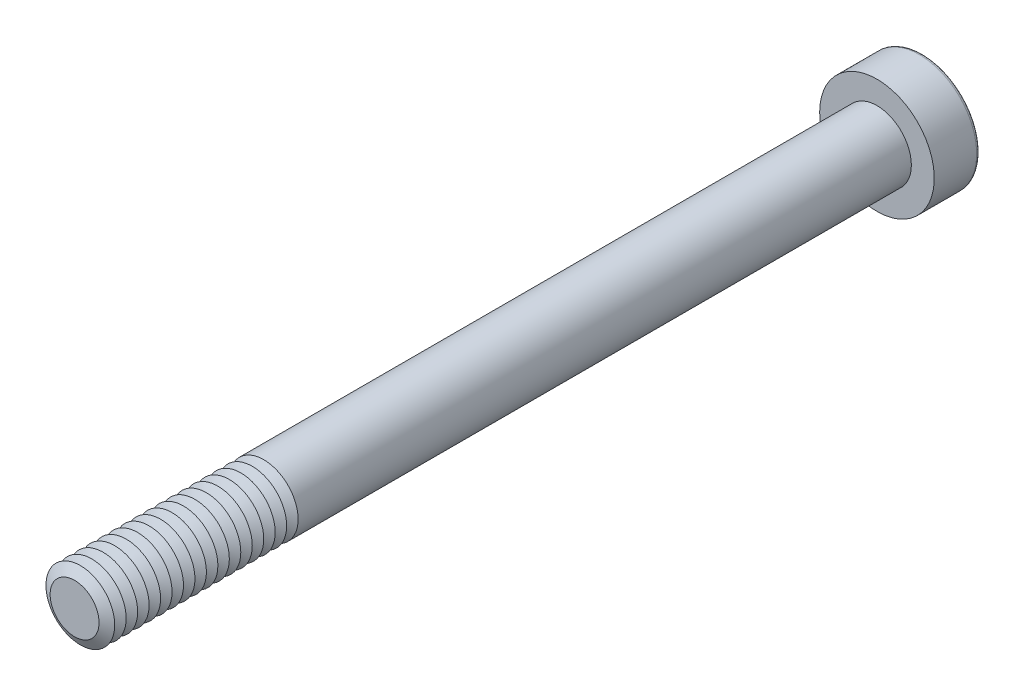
ISO-10303-21;
HEADER;
FILE_DESCRIPTION(('STEP AP214'),'2;1');
FILE_NAME('part.step','',(''),(''),'','','');
FILE_SCHEMA(('AUTOMOTIVE_DESIGN { 1 0 10303 214 1 1 1 1 }'));
ENDSEC;
DATA;
#1=APPLICATION_CONTEXT('core data for automotive mechanical design processes');
#2=APPLICATION_PROTOCOL_DEFINITION('international standard','automotive_design',2000,#1);
#3=PRODUCT_CONTEXT('',#1,'mechanical');
#4=PRODUCT('Part','Part','',(#3));
#5=PRODUCT_RELATED_PRODUCT_CATEGORY('part','',(#4));
#6=PRODUCT_DEFINITION_FORMATION('','',#4);
#7=PRODUCT_DEFINITION_CONTEXT('part definition',#1,'design');
#8=PRODUCT_DEFINITION('design','',#6,#7);
#9=PRODUCT_DEFINITION_SHAPE('','',#8);
#10=(LENGTH_UNIT() NAMED_UNIT(*) SI_UNIT(.MILLI.,.METRE.));
#11=(NAMED_UNIT(*) PLANE_ANGLE_UNIT() SI_UNIT($,.RADIAN.));
#12=(NAMED_UNIT(*) SI_UNIT($,.STERADIAN.) SOLID_ANGLE_UNIT());
#13=UNCERTAINTY_MEASURE_WITH_UNIT(LENGTH_MEASURE(1.E-05),#10,'distance_accuracy_value','');
#14=(GEOMETRIC_REPRESENTATION_CONTEXT(3) GLOBAL_UNCERTAINTY_ASSIGNED_CONTEXT((#13)) GLOBAL_UNIT_ASSIGNED_CONTEXT((#10,
#11,#12)) REPRESENTATION_CONTEXT('',''));
#15=CARTESIAN_POINT('',(0.,0.,0.));
#16=DIRECTION('',(0.,0.,1.));
#17=DIRECTION('',(1.,0.,0.));
#18=AXIS2_PLACEMENT_3D('',#15,#16,#17);
#19=CARTESIAN_POINT('',(0.,0.,66.5));
#20=DIRECTION('',(0.,0.,1.));
#21=DIRECTION('',(1.,0.,0.));
#22=AXIS2_PLACEMENT_3D('',#19,#20,#21);
#23=CONICAL_SURFACE('',#22,3.,1.0471975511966);
#24=CARTESIAN_POINT('',(0.,0.,66.));
#25=DIRECTION('',(0.,0.,1.));
#26=DIRECTION('',(1.,0.,0.));
#27=AXIS2_PLACEMENT_3D('',#24,#25,#26);
#28=CIRCLE('',#27,2.13397459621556);
#29=CARTESIAN_POINT('',(2.13397459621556,0.,66.));
#30=VERTEX_POINT('',#29);
#31=EDGE_CURVE('E313',#30,#30,#28,.T.);
#32=ORIENTED_EDGE('',*,*,#31,.T.);
#33=EDGE_LOOP('',(#32));
#34=FACE_BOUND('',#33,.T.);
#35=CARTESIAN_POINT('',(0.,0.,66.5));
#36=DIRECTION('',(0.,0.,1.));
#37=DIRECTION('',(1.,0.,0.));
#38=AXIS2_PLACEMENT_3D('',#35,#36,#37);
#39=CIRCLE('',#38,3.);
#40=CARTESIAN_POINT('',(3.,0.,66.5));
#41=VERTEX_POINT('',#40);
#42=EDGE_CURVE('E316',#41,#41,#39,.T.);
#43=ORIENTED_EDGE('',*,*,#42,.F.);
#44=EDGE_LOOP('',(#43));
#45=FACE_BOUND('',#44,.T.);
#46=ADVANCED_FACE('F39',(#34,#45),#23,.T.);
#47=CARTESIAN_POINT('',(0.,0.,66.));
#48=DIRECTION('',(0.,0.,-1.));
#49=DIRECTION('',(-1.,0.,0.));
#50=AXIS2_PLACEMENT_3D('',#47,#48,#49);
#51=CONICAL_SURFACE('',#50,2.13397459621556,1.0471975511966);
#52=CARTESIAN_POINT('',(0.,0.,65.5));
#53=DIRECTION('',(0.,0.,1.));
#54=DIRECTION('',(1.,0.,0.));
#55=AXIS2_PLACEMENT_3D('',#52,#53,#54);
#56=CIRCLE('',#55,3.);
#57=CARTESIAN_POINT('',(3.,0.,65.5));
#58=VERTEX_POINT('',#57);
#59=EDGE_CURVE('E324',#58,#58,#56,.T.);
#60=ORIENTED_EDGE('',*,*,#59,.T.);
#61=EDGE_LOOP('',(#60));
#62=FACE_BOUND('',#61,.T.);
#63=ORIENTED_EDGE('',*,*,#31,.F.);
#64=EDGE_LOOP('',(#63));
#65=FACE_BOUND('',#64,.T.);
#66=ADVANCED_FACE('F244',(#62,#65),#51,.T.);
#67=CARTESIAN_POINT('',(0.,0.,70.));
#68=DIRECTION('',(0.,0.,1.));
#69=DIRECTION('',(1.,0.,0.));
#70=AXIS2_PLACEMENT_3D('',#67,#68,#69);
#71=PLANE('',#70);
#72=CARTESIAN_POINT('',(0.,0.,70.));
#73=DIRECTION('',(0.,0.,1.));
#74=DIRECTION('',(1.,0.,0.));
#75=AXIS2_PLACEMENT_3D('',#72,#73,#74);
#76=CIRCLE('',#75,2.13397459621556);
#77=CARTESIAN_POINT('',(2.13397459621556,0.,70.));
#78=VERTEX_POINT('',#77);
#79=EDGE_CURVE('E173',#78,#78,#76,.T.);
#80=ORIENTED_EDGE('',*,*,#79,.T.);
#81=EDGE_LOOP('',(#80));
#82=FACE_BOUND('',#81,.T.);
#83=ADVANCED_FACE('F250',(#82),#71,.T.);
#84=CARTESIAN_POINT('',(0.,0.,70.));
#85=DIRECTION('',(0.,0.,-1.));
#86=DIRECTION('',(-1.,0.,0.));
#87=AXIS2_PLACEMENT_3D('',#84,#85,#86);
#88=CONICAL_SURFACE('',#87,2.13397459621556,1.0471975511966);
#89=CARTESIAN_POINT('',(0.,0.,69.5));
#90=DIRECTION('',(0.,0.,1.));
#91=DIRECTION('',(1.,0.,0.));
#92=AXIS2_PLACEMENT_3D('',#89,#90,#91);
#93=CIRCLE('',#92,3.);
#94=CARTESIAN_POINT('',(3.,0.,69.5));
#95=VERTEX_POINT('',#94);
#96=EDGE_CURVE('E290',#95,#95,#93,.T.);
#97=ORIENTED_EDGE('',*,*,#96,.T.);
#98=EDGE_LOOP('',(#97));
#99=FACE_BOUND('',#98,.T.);
#100=ORIENTED_EDGE('',*,*,#79,.F.);
#101=EDGE_LOOP('',(#100));
#102=FACE_BOUND('',#101,.T.);
#103=ADVANCED_FACE('F198',(#99,#102),#88,.T.);
#104=CARTESIAN_POINT('',(0.,0.,69.5));
#105=DIRECTION('',(0.,0.,1.));
#106=DIRECTION('',(1.,0.,0.));
#107=AXIS2_PLACEMENT_3D('',#104,#105,#106);
#108=CONICAL_SURFACE('',#107,3.,1.0471975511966);
#109=CARTESIAN_POINT('',(0.,0.,69.));
#110=DIRECTION('',(0.,0.,1.));
#111=DIRECTION('',(1.,0.,0.));
#112=AXIS2_PLACEMENT_3D('',#109,#110,#111);
#113=CIRCLE('',#112,2.13397459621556);
#114=CARTESIAN_POINT('',(2.13397459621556,0.,69.));
#115=VERTEX_POINT('',#114);
#116=EDGE_CURVE('E287',#115,#115,#113,.T.);
#117=ORIENTED_EDGE('',*,*,#116,.T.);
#118=EDGE_LOOP('',(#117));
#119=FACE_BOUND('',#118,.T.);
#120=ORIENTED_EDGE('',*,*,#96,.F.);
#121=EDGE_LOOP('',(#120));
#122=FACE_BOUND('',#121,.T.);
#123=ADVANCED_FACE('F276',(#119,#122),#108,.T.);
#124=CARTESIAN_POINT('',(0.,0.,69.));
#125=DIRECTION('',(0.,0.,-1.));
#126=DIRECTION('',(-1.,0.,0.));
#127=AXIS2_PLACEMENT_3D('',#124,#125,#126);
#128=CONICAL_SURFACE('',#127,2.13397459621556,1.0471975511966);
#129=CARTESIAN_POINT('',(0.,0.,68.5));
#130=DIRECTION('',(0.,0.,1.));
#131=DIRECTION('',(1.,0.,0.));
#132=AXIS2_PLACEMENT_3D('',#129,#130,#131);
#133=CIRCLE('',#132,3.);
#134=CARTESIAN_POINT('',(3.,0.,68.5));
#135=VERTEX_POINT('',#134);
#136=EDGE_CURVE('E299',#135,#135,#133,.T.);
#137=ORIENTED_EDGE('',*,*,#136,.T.);
#138=EDGE_LOOP('',(#137));
#139=FACE_BOUND('',#138,.T.);
#140=ORIENTED_EDGE('',*,*,#116,.F.);
#141=EDGE_LOOP('',(#140));
#142=FACE_BOUND('',#141,.T.);
#143=ADVANCED_FACE('F273',(#139,#142),#128,.T.);
#144=CARTESIAN_POINT('',(0.,0.,68.5));
#145=DIRECTION('',(0.,0.,1.));
#146=DIRECTION('',(1.,0.,0.));
#147=AXIS2_PLACEMENT_3D('',#144,#145,#146);
#148=CONICAL_SURFACE('',#147,3.,1.0471975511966);
#149=CARTESIAN_POINT('',(0.,0.,68.));
#150=DIRECTION('',(0.,0.,1.));
#151=DIRECTION('',(1.,0.,0.));
#152=AXIS2_PLACEMENT_3D('',#149,#150,#151);
#153=CIRCLE('',#152,2.13397459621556);
#154=CARTESIAN_POINT('',(2.13397459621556,0.,68.));
#155=VERTEX_POINT('',#154);
#156=EDGE_CURVE('E292',#155,#155,#153,.T.);
#157=ORIENTED_EDGE('',*,*,#156,.T.);
#158=EDGE_LOOP('',(#157));
#159=FACE_BOUND('',#158,.T.);
#160=ORIENTED_EDGE('',*,*,#136,.F.);
#161=EDGE_LOOP('',(#160));
#162=FACE_BOUND('',#161,.T.);
#163=ADVANCED_FACE('F269',(#159,#162),#148,.T.);
#164=CARTESIAN_POINT('',(0.,0.,68.));
#165=DIRECTION('',(0.,0.,-1.));
#166=DIRECTION('',(-1.,0.,0.));
#167=AXIS2_PLACEMENT_3D('',#164,#165,#166);
#168=CONICAL_SURFACE('',#167,2.13397459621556,1.0471975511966);
#169=CARTESIAN_POINT('',(0.,0.,67.5));
#170=DIRECTION('',(0.,0.,1.));
#171=DIRECTION('',(1.,0.,0.));
#172=AXIS2_PLACEMENT_3D('',#169,#170,#171);
#173=CIRCLE('',#172,3.);
#174=CARTESIAN_POINT('',(3.,0.,67.5));
#175=VERTEX_POINT('',#174);
#176=EDGE_CURVE('E309',#175,#175,#173,.T.);
#177=ORIENTED_EDGE('',*,*,#176,.T.);
#178=EDGE_LOOP('',(#177));
#179=FACE_BOUND('',#178,.T.);
#180=ORIENTED_EDGE('',*,*,#156,.F.);
#181=EDGE_LOOP('',(#180));
#182=FACE_BOUND('',#181,.T.);
#183=ADVANCED_FACE('F265',(#179,#182),#168,.T.);
#184=CARTESIAN_POINT('',(0.,0.,67.5));
#185=DIRECTION('',(0.,0.,1.));
#186=DIRECTION('',(1.,0.,0.));
#187=AXIS2_PLACEMENT_3D('',#184,#185,#186);
#188=CONICAL_SURFACE('',#187,3.,1.0471975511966);
#189=CARTESIAN_POINT('',(0.,0.,67.));
#190=DIRECTION('',(0.,0.,1.));
#191=DIRECTION('',(1.,0.,0.));
#192=AXIS2_PLACEMENT_3D('',#189,#190,#191);
#193=CIRCLE('',#192,2.13397459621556);
#194=CARTESIAN_POINT('',(2.13397459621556,0.,67.));
#195=VERTEX_POINT('',#194);
#196=EDGE_CURVE('E305',#195,#195,#193,.T.);
#197=ORIENTED_EDGE('',*,*,#196,.T.);
#198=EDGE_LOOP('',(#197));
#199=FACE_BOUND('',#198,.T.);
#200=ORIENTED_EDGE('',*,*,#176,.F.);
#201=EDGE_LOOP('',(#200));
#202=FACE_BOUND('',#201,.T.);
#203=ADVANCED_FACE('F261',(#199,#202),#188,.T.);
#204=CARTESIAN_POINT('',(0.,0.,67.));
#205=DIRECTION('',(0.,0.,-1.));
#206=DIRECTION('',(-1.,0.,0.));
#207=AXIS2_PLACEMENT_3D('',#204,#205,#206);
#208=CONICAL_SURFACE('',#207,2.13397459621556,1.0471975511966);
#209=ORIENTED_EDGE('',*,*,#42,.T.);
#210=EDGE_LOOP('',(#209));
#211=FACE_BOUND('',#210,.T.);
#212=ORIENTED_EDGE('',*,*,#196,.F.);
#213=EDGE_LOOP('',(#212));
#214=FACE_BOUND('',#213,.T.);
#215=ADVANCED_FACE('F257',(#211,#214),#208,.T.);
#216=CARTESIAN_POINT('',(0.,0.,65.5));
#217=DIRECTION('',(0.,0.,1.));
#218=DIRECTION('',(1.,0.,0.));
#219=AXIS2_PLACEMENT_3D('',#216,#217,#218);
#220=CONICAL_SURFACE('',#219,3.,1.0471975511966);
#221=CARTESIAN_POINT('',(0.,0.,65.));
#222=DIRECTION('',(0.,0.,1.));
#223=DIRECTION('',(1.,0.,0.));
#224=AXIS2_PLACEMENT_3D('',#221,#222,#223);
#225=CIRCLE('',#224,2.13397459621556);
#226=CARTESIAN_POINT('',(2.13397459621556,0.,65.));
#227=VERTEX_POINT('',#226);
#228=EDGE_CURVE('E320',#227,#227,#225,.T.);
#229=ORIENTED_EDGE('',*,*,#228,.T.);
#230=EDGE_LOOP('',(#229));
#231=FACE_BOUND('',#230,.T.);
#232=ORIENTED_EDGE('',*,*,#59,.F.);
#233=EDGE_LOOP('',(#232));
#234=FACE_BOUND('',#233,.T.);
#235=ADVANCED_FACE('F260',(#231,#234),#220,.T.);
#236=CARTESIAN_POINT('',(0.,0.,65.));
#237=DIRECTION('',(0.,0.,-1.));
#238=DIRECTION('',(-1.,0.,0.));
#239=AXIS2_PLACEMENT_3D('',#236,#237,#238);
#240=CONICAL_SURFACE('',#239,2.13397459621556,1.0471975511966);
#241=CARTESIAN_POINT('',(0.,0.,64.5));
#242=DIRECTION('',(0.,0.,1.));
#243=DIRECTION('',(1.,0.,0.));
#244=AXIS2_PLACEMENT_3D('',#241,#242,#243);
#245=CIRCLE('',#244,3.);
#246=CARTESIAN_POINT('',(3.,0.,64.5));
#247=VERTEX_POINT('',#246);
#248=EDGE_CURVE('E332',#247,#247,#245,.T.);
#249=ORIENTED_EDGE('',*,*,#248,.T.);
#250=EDGE_LOOP('',(#249));
#251=FACE_BOUND('',#250,.T.);
#252=ORIENTED_EDGE('',*,*,#228,.F.);
#253=EDGE_LOOP('',(#252));
#254=FACE_BOUND('',#253,.T.);
#255=ADVANCED_FACE('F511',(#251,#254),#240,.T.);
#256=CARTESIAN_POINT('',(0.,0.,64.5));
#257=DIRECTION('',(0.,0.,1.));
#258=DIRECTION('',(1.,0.,0.));
#259=AXIS2_PLACEMENT_3D('',#256,#257,#258);
#260=CONICAL_SURFACE('',#259,3.,1.0471975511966);
#261=CARTESIAN_POINT('',(0.,0.,64.));
#262=DIRECTION('',(0.,0.,1.));
#263=DIRECTION('',(1.,0.,0.));
#264=AXIS2_PLACEMENT_3D('',#261,#262,#263);
#265=CIRCLE('',#264,2.13397459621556);
#266=CARTESIAN_POINT('',(2.13397459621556,0.,64.));
#267=VERTEX_POINT('',#266);
#268=EDGE_CURVE('E328',#267,#267,#265,.T.);
#269=ORIENTED_EDGE('',*,*,#268,.T.);
#270=EDGE_LOOP('',(#269));
#271=FACE_BOUND('',#270,.T.);
#272=ORIENTED_EDGE('',*,*,#248,.F.);
#273=EDGE_LOOP('',(#272));
#274=FACE_BOUND('',#273,.T.);
#275=ADVANCED_FACE('F507',(#271,#274),#260,.T.);
#276=CARTESIAN_POINT('',(0.,0.,64.));
#277=DIRECTION('',(0.,0.,-1.));
#278=DIRECTION('',(-1.,0.,0.));
#279=AXIS2_PLACEMENT_3D('',#276,#277,#278);
#280=CONICAL_SURFACE('',#279,2.13397459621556,1.0471975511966);
#281=CARTESIAN_POINT('',(0.,0.,63.5));
#282=DIRECTION('',(0.,0.,1.));
#283=DIRECTION('',(1.,0.,0.));
#284=AXIS2_PLACEMENT_3D('',#281,#282,#283);
#285=CIRCLE('',#284,3.);
#286=CARTESIAN_POINT('',(3.,0.,63.5));
#287=VERTEX_POINT('',#286);
#288=EDGE_CURVE('E340',#287,#287,#285,.T.);
#289=ORIENTED_EDGE('',*,*,#288,.T.);
#290=EDGE_LOOP('',(#289));
#291=FACE_BOUND('',#290,.T.);
#292=ORIENTED_EDGE('',*,*,#268,.F.);
#293=EDGE_LOOP('',(#292));
#294=FACE_BOUND('',#293,.T.);
#295=ADVANCED_FACE('F503',(#291,#294),#280,.T.);
#296=CARTESIAN_POINT('',(0.,0.,63.5));
#297=DIRECTION('',(0.,0.,1.));
#298=DIRECTION('',(1.,0.,0.));
#299=AXIS2_PLACEMENT_3D('',#296,#297,#298);
#300=CONICAL_SURFACE('',#299,3.,1.0471975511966);
#301=CARTESIAN_POINT('',(0.,0.,63.));
#302=DIRECTION('',(0.,0.,1.));
#303=DIRECTION('',(1.,0.,0.));
#304=AXIS2_PLACEMENT_3D('',#301,#302,#303);
#305=CIRCLE('',#304,2.13397459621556);
#306=CARTESIAN_POINT('',(2.13397459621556,0.,63.));
#307=VERTEX_POINT('',#306);
#308=EDGE_CURVE('E336',#307,#307,#305,.T.);
#309=ORIENTED_EDGE('',*,*,#308,.T.);
#310=EDGE_LOOP('',(#309));
#311=FACE_BOUND('',#310,.T.);
#312=ORIENTED_EDGE('',*,*,#288,.F.);
#313=EDGE_LOOP('',(#312));
#314=FACE_BOUND('',#313,.T.);
#315=ADVANCED_FACE('F499',(#311,#314),#300,.T.);
#316=CARTESIAN_POINT('',(0.,0.,63.));
#317=DIRECTION('',(0.,0.,-1.));
#318=DIRECTION('',(-1.,0.,0.));
#319=AXIS2_PLACEMENT_3D('',#316,#317,#318);
#320=CONICAL_SURFACE('',#319,2.13397459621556,1.0471975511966);
#321=CARTESIAN_POINT('',(0.,0.,62.5));
#322=DIRECTION('',(0.,0.,1.));
#323=DIRECTION('',(1.,0.,0.));
#324=AXIS2_PLACEMENT_3D('',#321,#322,#323);
#325=CIRCLE('',#324,3.);
#326=CARTESIAN_POINT('',(3.,0.,62.5));
#327=VERTEX_POINT('',#326);
#328=EDGE_CURVE('E348',#327,#327,#325,.T.);
#329=ORIENTED_EDGE('',*,*,#328,.T.);
#330=EDGE_LOOP('',(#329));
#331=FACE_BOUND('',#330,.T.);
#332=ORIENTED_EDGE('',*,*,#308,.F.);
#333=EDGE_LOOP('',(#332));
#334=FACE_BOUND('',#333,.T.);
#335=ADVANCED_FACE('F495',(#331,#334),#320,.T.);
#336=CARTESIAN_POINT('',(0.,0.,62.5));
#337=DIRECTION('',(0.,0.,1.));
#338=DIRECTION('',(1.,0.,0.));
#339=AXIS2_PLACEMENT_3D('',#336,#337,#338);
#340=CONICAL_SURFACE('',#339,3.,1.0471975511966);
#341=CARTESIAN_POINT('',(0.,0.,62.));
#342=DIRECTION('',(0.,0.,1.));
#343=DIRECTION('',(1.,0.,0.));
#344=AXIS2_PLACEMENT_3D('',#341,#342,#343);
#345=CIRCLE('',#344,2.13397459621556);
#346=CARTESIAN_POINT('',(2.13397459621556,0.,62.));
#347=VERTEX_POINT('',#346);
#348=EDGE_CURVE('E344',#347,#347,#345,.T.);
#349=ORIENTED_EDGE('',*,*,#348,.T.);
#350=EDGE_LOOP('',(#349));
#351=FACE_BOUND('',#350,.T.);
#352=ORIENTED_EDGE('',*,*,#328,.F.);
#353=EDGE_LOOP('',(#352));
#354=FACE_BOUND('',#353,.T.);
#355=ADVANCED_FACE('F491',(#351,#354),#340,.T.);
#356=CARTESIAN_POINT('',(0.,0.,62.));
#357=DIRECTION('',(0.,0.,-1.));
#358=DIRECTION('',(-1.,0.,0.));
#359=AXIS2_PLACEMENT_3D('',#356,#357,#358);
#360=CONICAL_SURFACE('',#359,2.13397459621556,1.0471975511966);
#361=CARTESIAN_POINT('',(0.,0.,61.5));
#362=DIRECTION('',(0.,0.,1.));
#363=DIRECTION('',(1.,0.,0.));
#364=AXIS2_PLACEMENT_3D('',#361,#362,#363);
#365=CIRCLE('',#364,3.);
#366=CARTESIAN_POINT('',(3.,0.,61.5));
#367=VERTEX_POINT('',#366);
#368=EDGE_CURVE('E356',#367,#367,#365,.T.);
#369=ORIENTED_EDGE('',*,*,#368,.T.);
#370=EDGE_LOOP('',(#369));
#371=FACE_BOUND('',#370,.T.);
#372=ORIENTED_EDGE('',*,*,#348,.F.);
#373=EDGE_LOOP('',(#372));
#374=FACE_BOUND('',#373,.T.);
#375=ADVANCED_FACE('F487',(#371,#374),#360,.T.);
#376=CARTESIAN_POINT('',(0.,0.,61.5));
#377=DIRECTION('',(0.,0.,1.));
#378=DIRECTION('',(1.,0.,0.));
#379=AXIS2_PLACEMENT_3D('',#376,#377,#378);
#380=CONICAL_SURFACE('',#379,3.,1.0471975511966);
#381=CARTESIAN_POINT('',(0.,0.,61.));
#382=DIRECTION('',(0.,0.,1.));
#383=DIRECTION('',(1.,0.,0.));
#384=AXIS2_PLACEMENT_3D('',#381,#382,#383);
#385=CIRCLE('',#384,2.13397459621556);
#386=CARTESIAN_POINT('',(2.13397459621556,0.,61.));
#387=VERTEX_POINT('',#386);
#388=EDGE_CURVE('E352',#387,#387,#385,.T.);
#389=ORIENTED_EDGE('',*,*,#388,.T.);
#390=EDGE_LOOP('',(#389));
#391=FACE_BOUND('',#390,.T.);
#392=ORIENTED_EDGE('',*,*,#368,.F.);
#393=EDGE_LOOP('',(#392));
#394=FACE_BOUND('',#393,.T.);
#395=ADVANCED_FACE('F483',(#391,#394),#380,.T.);
#396=CARTESIAN_POINT('',(0.,0.,61.));
#397=DIRECTION('',(0.,0.,-1.));
#398=DIRECTION('',(-1.,0.,0.));
#399=AXIS2_PLACEMENT_3D('',#396,#397,#398);
#400=CONICAL_SURFACE('',#399,2.13397459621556,1.0471975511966);
#401=CARTESIAN_POINT('',(0.,0.,60.5));
#402=DIRECTION('',(0.,0.,1.));
#403=DIRECTION('',(1.,0.,0.));
#404=AXIS2_PLACEMENT_3D('',#401,#402,#403);
#405=CIRCLE('',#404,3.);
#406=CARTESIAN_POINT('',(3.,0.,60.5));
#407=VERTEX_POINT('',#406);
#408=EDGE_CURVE('E364',#407,#407,#405,.T.);
#409=ORIENTED_EDGE('',*,*,#408,.T.);
#410=EDGE_LOOP('',(#409));
#411=FACE_BOUND('',#410,.T.);
#412=ORIENTED_EDGE('',*,*,#388,.F.);
#413=EDGE_LOOP('',(#412));
#414=FACE_BOUND('',#413,.T.);
#415=ADVANCED_FACE('F479',(#411,#414),#400,.T.);
#416=CARTESIAN_POINT('',(0.,0.,60.5));
#417=DIRECTION('',(0.,0.,1.));
#418=DIRECTION('',(1.,0.,0.));
#419=AXIS2_PLACEMENT_3D('',#416,#417,#418);
#420=CONICAL_SURFACE('',#419,3.,1.0471975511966);
#421=CARTESIAN_POINT('',(0.,0.,60.));
#422=DIRECTION('',(0.,0.,1.));
#423=DIRECTION('',(1.,0.,0.));
#424=AXIS2_PLACEMENT_3D('',#421,#422,#423);
#425=CIRCLE('',#424,2.13397459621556);
#426=CARTESIAN_POINT('',(2.13397459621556,0.,60.));
#427=VERTEX_POINT('',#426);
#428=EDGE_CURVE('E360',#427,#427,#425,.T.);
#429=ORIENTED_EDGE('',*,*,#428,.T.);
#430=EDGE_LOOP('',(#429));
#431=FACE_BOUND('',#430,.T.);
#432=ORIENTED_EDGE('',*,*,#408,.F.);
#433=EDGE_LOOP('',(#432));
#434=FACE_BOUND('',#433,.T.);
#435=ADVANCED_FACE('F475',(#431,#434),#420,.T.);
#436=CARTESIAN_POINT('',(0.,0.,60.));
#437=DIRECTION('',(0.,0.,-1.));
#438=DIRECTION('',(-1.,0.,0.));
#439=AXIS2_PLACEMENT_3D('',#436,#437,#438);
#440=CONICAL_SURFACE('',#439,2.13397459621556,1.0471975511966);
#441=CARTESIAN_POINT('',(0.,0.,59.5));
#442=DIRECTION('',(0.,0.,1.));
#443=DIRECTION('',(1.,0.,0.));
#444=AXIS2_PLACEMENT_3D('',#441,#442,#443);
#445=CIRCLE('',#444,3.);
#446=CARTESIAN_POINT('',(3.,0.,59.5));
#447=VERTEX_POINT('',#446);
#448=EDGE_CURVE('E371',#447,#447,#445,.T.);
#449=ORIENTED_EDGE('',*,*,#448,.T.);
#450=EDGE_LOOP('',(#449));
#451=FACE_BOUND('',#450,.T.);
#452=ORIENTED_EDGE('',*,*,#428,.F.);
#453=EDGE_LOOP('',(#452));
#454=FACE_BOUND('',#453,.T.);
#455=ADVANCED_FACE('F471',(#451,#454),#440,.T.);
#456=CARTESIAN_POINT('',(0.,0.,59.5));
#457=DIRECTION('',(0.,0.,1.));
#458=DIRECTION('',(1.,0.,0.));
#459=AXIS2_PLACEMENT_3D('',#456,#457,#458);
#460=CONICAL_SURFACE('',#459,3.,1.0471975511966);
#461=CARTESIAN_POINT('',(0.,0.,59.));
#462=DIRECTION('',(0.,0.,1.));
#463=DIRECTION('',(1.,0.,0.));
#464=AXIS2_PLACEMENT_3D('',#461,#462,#463);
#465=CIRCLE('',#464,2.13397459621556);
#466=CARTESIAN_POINT('',(2.13397459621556,0.,59.));
#467=VERTEX_POINT('',#466);
#468=EDGE_CURVE('E367',#467,#467,#465,.T.);
#469=ORIENTED_EDGE('',*,*,#468,.T.);
#470=EDGE_LOOP('',(#469));
#471=FACE_BOUND('',#470,.T.);
#472=ORIENTED_EDGE('',*,*,#448,.F.);
#473=EDGE_LOOP('',(#472));
#474=FACE_BOUND('',#473,.T.);
#475=ADVANCED_FACE('F467',(#471,#474),#460,.T.);
#476=CARTESIAN_POINT('',(0.,0.,59.));
#477=DIRECTION('',(0.,0.,-1.));
#478=DIRECTION('',(-1.,0.,0.));
#479=AXIS2_PLACEMENT_3D('',#476,#477,#478);
#480=CONICAL_SURFACE('',#479,2.13397459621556,1.0471975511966);
#481=CARTESIAN_POINT('',(0.,0.,58.5));
#482=DIRECTION('',(0.,0.,1.));
#483=DIRECTION('',(1.,0.,0.));
#484=AXIS2_PLACEMENT_3D('',#481,#482,#483);
#485=CIRCLE('',#484,3.);
#486=CARTESIAN_POINT('',(3.,0.,58.5));
#487=VERTEX_POINT('',#486);
#488=EDGE_CURVE('E379',#487,#487,#485,.T.);
#489=ORIENTED_EDGE('',*,*,#488,.T.);
#490=EDGE_LOOP('',(#489));
#491=FACE_BOUND('',#490,.T.);
#492=ORIENTED_EDGE('',*,*,#468,.F.);
#493=EDGE_LOOP('',(#492));
#494=FACE_BOUND('',#493,.T.);
#495=ADVANCED_FACE('F463',(#491,#494),#480,.T.);
#496=CARTESIAN_POINT('',(0.,0.,58.5));
#497=DIRECTION('',(0.,0.,1.));
#498=DIRECTION('',(1.,0.,0.));
#499=AXIS2_PLACEMENT_3D('',#496,#497,#498);
#500=CONICAL_SURFACE('',#499,3.,1.0471975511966);
#501=CARTESIAN_POINT('',(0.,0.,58.));
#502=DIRECTION('',(0.,0.,1.));
#503=DIRECTION('',(1.,0.,0.));
#504=AXIS2_PLACEMENT_3D('',#501,#502,#503);
#505=CIRCLE('',#504,2.13397459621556);
#506=CARTESIAN_POINT('',(2.13397459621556,0.,58.));
#507=VERTEX_POINT('',#506);
#508=EDGE_CURVE('E375',#507,#507,#505,.T.);
#509=ORIENTED_EDGE('',*,*,#508,.T.);
#510=EDGE_LOOP('',(#509));
#511=FACE_BOUND('',#510,.T.);
#512=ORIENTED_EDGE('',*,*,#488,.F.);
#513=EDGE_LOOP('',(#512));
#514=FACE_BOUND('',#513,.T.);
#515=ADVANCED_FACE('F459',(#511,#514),#500,.T.);
#516=CARTESIAN_POINT('',(0.,0.,58.));
#517=DIRECTION('',(0.,0.,-1.));
#518=DIRECTION('',(-1.,0.,0.));
#519=AXIS2_PLACEMENT_3D('',#516,#517,#518);
#520=CONICAL_SURFACE('',#519,2.13397459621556,1.0471975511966);
#521=CARTESIAN_POINT('',(0.,0.,57.5));
#522=DIRECTION('',(0.,0.,1.));
#523=DIRECTION('',(1.,0.,0.));
#524=AXIS2_PLACEMENT_3D('',#521,#522,#523);
#525=CIRCLE('',#524,3.);
#526=CARTESIAN_POINT('',(3.,0.,57.5));
#527=VERTEX_POINT('',#526);
#528=EDGE_CURVE('E387',#527,#527,#525,.T.);
#529=ORIENTED_EDGE('',*,*,#528,.T.);
#530=EDGE_LOOP('',(#529));
#531=FACE_BOUND('',#530,.T.);
#532=ORIENTED_EDGE('',*,*,#508,.F.);
#533=EDGE_LOOP('',(#532));
#534=FACE_BOUND('',#533,.T.);
#535=ADVANCED_FACE('F455',(#531,#534),#520,.T.);
#536=CARTESIAN_POINT('',(0.,0.,57.5));
#537=DIRECTION('',(0.,0.,1.));
#538=DIRECTION('',(1.,0.,0.));
#539=AXIS2_PLACEMENT_3D('',#536,#537,#538);
#540=CONICAL_SURFACE('',#539,3.,1.0471975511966);
#541=CARTESIAN_POINT('',(0.,0.,57.));
#542=DIRECTION('',(0.,0.,1.));
#543=DIRECTION('',(1.,0.,0.));
#544=AXIS2_PLACEMENT_3D('',#541,#542,#543);
#545=CIRCLE('',#544,2.13397459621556);
#546=CARTESIAN_POINT('',(2.13397459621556,0.,57.));
#547=VERTEX_POINT('',#546);
#548=EDGE_CURVE('E383',#547,#547,#545,.T.);
#549=ORIENTED_EDGE('',*,*,#548,.T.);
#550=EDGE_LOOP('',(#549));
#551=FACE_BOUND('',#550,.T.);
#552=ORIENTED_EDGE('',*,*,#528,.F.);
#553=EDGE_LOOP('',(#552));
#554=FACE_BOUND('',#553,.T.);
#555=ADVANCED_FACE('F451',(#551,#554),#540,.T.);
#556=CARTESIAN_POINT('',(0.,0.,57.));
#557=DIRECTION('',(0.,0.,-1.));
#558=DIRECTION('',(-1.,0.,0.));
#559=AXIS2_PLACEMENT_3D('',#556,#557,#558);
#560=CONICAL_SURFACE('',#559,2.13397459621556,1.0471975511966);
#561=CARTESIAN_POINT('',(0.,0.,56.5));
#562=DIRECTION('',(0.,0.,1.));
#563=DIRECTION('',(1.,0.,0.));
#564=AXIS2_PLACEMENT_3D('',#561,#562,#563);
#565=CIRCLE('',#564,3.);
#566=CARTESIAN_POINT('',(3.,0.,56.5));
#567=VERTEX_POINT('',#566);
#568=EDGE_CURVE('E395',#567,#567,#565,.T.);
#569=ORIENTED_EDGE('',*,*,#568,.T.);
#570=EDGE_LOOP('',(#569));
#571=FACE_BOUND('',#570,.T.);
#572=ORIENTED_EDGE('',*,*,#548,.F.);
#573=EDGE_LOOP('',(#572));
#574=FACE_BOUND('',#573,.T.);
#575=ADVANCED_FACE('F447',(#571,#574),#560,.T.);
#576=CARTESIAN_POINT('',(0.,0.,56.5));
#577=DIRECTION('',(0.,0.,1.));
#578=DIRECTION('',(1.,0.,0.));
#579=AXIS2_PLACEMENT_3D('',#576,#577,#578);
#580=CONICAL_SURFACE('',#579,3.,1.0471975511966);
#581=CARTESIAN_POINT('',(0.,0.,56.));
#582=DIRECTION('',(0.,0.,1.));
#583=DIRECTION('',(1.,0.,0.));
#584=AXIS2_PLACEMENT_3D('',#581,#582,#583);
#585=CIRCLE('',#584,2.13397459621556);
#586=CARTESIAN_POINT('',(2.13397459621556,0.,56.));
#587=VERTEX_POINT('',#586);
#588=EDGE_CURVE('E391',#587,#587,#585,.T.);
#589=ORIENTED_EDGE('',*,*,#588,.T.);
#590=EDGE_LOOP('',(#589));
#591=FACE_BOUND('',#590,.T.);
#592=ORIENTED_EDGE('',*,*,#568,.F.);
#593=EDGE_LOOP('',(#592));
#594=FACE_BOUND('',#593,.T.);
#595=ADVANCED_FACE('F443',(#591,#594),#580,.T.);
#596=CARTESIAN_POINT('',(0.,0.,56.));
#597=DIRECTION('',(0.,0.,-1.));
#598=DIRECTION('',(-1.,0.,0.));
#599=AXIS2_PLACEMENT_3D('',#596,#597,#598);
#600=CONICAL_SURFACE('',#599,2.13397459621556,1.0471975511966);
#601=CARTESIAN_POINT('',(0.,0.,55.5));
#602=DIRECTION('',(0.,0.,1.));
#603=DIRECTION('',(1.,0.,0.));
#604=AXIS2_PLACEMENT_3D('',#601,#602,#603);
#605=CIRCLE('',#604,3.);
#606=CARTESIAN_POINT('',(3.,0.,55.5));
#607=VERTEX_POINT('',#606);
#608=EDGE_CURVE('E403',#607,#607,#605,.T.);
#609=ORIENTED_EDGE('',*,*,#608,.T.);
#610=EDGE_LOOP('',(#609));
#611=FACE_BOUND('',#610,.T.);
#612=ORIENTED_EDGE('',*,*,#588,.F.);
#613=EDGE_LOOP('',(#612));
#614=FACE_BOUND('',#613,.T.);
#615=ADVANCED_FACE('F439',(#611,#614),#600,.T.);
#616=CARTESIAN_POINT('',(0.,0.,55.5));
#617=DIRECTION('',(0.,0.,1.));
#618=DIRECTION('',(1.,0.,0.));
#619=AXIS2_PLACEMENT_3D('',#616,#617,#618);
#620=CONICAL_SURFACE('',#619,3.,1.0471975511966);
#621=CARTESIAN_POINT('',(0.,0.,55.));
#622=DIRECTION('',(0.,0.,1.));
#623=DIRECTION('',(1.,0.,0.));
#624=AXIS2_PLACEMENT_3D('',#621,#622,#623);
#625=CIRCLE('',#624,2.13397459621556);
#626=CARTESIAN_POINT('',(2.13397459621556,0.,55.));
#627=VERTEX_POINT('',#626);
#628=EDGE_CURVE('E399',#627,#627,#625,.T.);
#629=ORIENTED_EDGE('',*,*,#628,.T.);
#630=EDGE_LOOP('',(#629));
#631=FACE_BOUND('',#630,.T.);
#632=ORIENTED_EDGE('',*,*,#608,.F.);
#633=EDGE_LOOP('',(#632));
#634=FACE_BOUND('',#633,.T.);
#635=ADVANCED_FACE('F434',(#631,#634),#620,.T.);
#636=CARTESIAN_POINT('',(0.,0.,55.));
#637=DIRECTION('',(0.,0.,-1.));
#638=DIRECTION('',(-1.,0.,0.));
#639=AXIS2_PLACEMENT_3D('',#636,#637,#638);
#640=CONICAL_SURFACE('',#639,2.13397459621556,1.0471975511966);
#641=CARTESIAN_POINT('',(0.,0.,54.5));
#642=DIRECTION('',(0.,0.,1.));
#643=DIRECTION('',(1.,0.,0.));
#644=AXIS2_PLACEMENT_3D('',#641,#642,#643);
#645=CIRCLE('',#644,3.);
#646=CARTESIAN_POINT('',(3.,0.,54.5));
#647=VERTEX_POINT('',#646);
#648=EDGE_CURVE('E415',#647,#647,#645,.T.);
#649=ORIENTED_EDGE('',*,*,#648,.T.);
#650=EDGE_LOOP('',(#649));
#651=FACE_BOUND('',#650,.T.);
#652=ORIENTED_EDGE('',*,*,#628,.F.);
#653=EDGE_LOOP('',(#652));
#654=FACE_BOUND('',#653,.T.);
#655=ADVANCED_FACE('F420',(#651,#654),#640,.T.);
#656=CARTESIAN_POINT('',(0.,0.,54.5));
#657=DIRECTION('',(0.,0.,1.));
#658=DIRECTION('',(1.,0.,0.));
#659=AXIS2_PLACEMENT_3D('',#656,#657,#658);
#660=CONICAL_SURFACE('',#659,3.,1.0471975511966);
#661=CARTESIAN_POINT('',(0.,0.,54.));
#662=DIRECTION('',(0.,0.,1.));
#663=DIRECTION('',(1.,0.,0.));
#664=AXIS2_PLACEMENT_3D('',#661,#662,#663);
#665=CIRCLE('',#664,2.13397459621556);
#666=CARTESIAN_POINT('',(2.13397459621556,0.,54.));
#667=VERTEX_POINT('',#666);
#668=EDGE_CURVE('E407',#667,#667,#665,.T.);
#669=ORIENTED_EDGE('',*,*,#668,.T.);
#670=EDGE_LOOP('',(#669));
#671=FACE_BOUND('',#670,.T.);
#672=ORIENTED_EDGE('',*,*,#648,.F.);
#673=EDGE_LOOP('',(#672));
#674=FACE_BOUND('',#673,.T.);
#675=ADVANCED_FACE('F423',(#671,#674),#660,.T.);
#676=CARTESIAN_POINT('',(0.,0.,54.));
#677=DIRECTION('',(0.,0.,-1.));
#678=DIRECTION('',(-1.,0.,0.));
#679=AXIS2_PLACEMENT_3D('',#676,#677,#678);
#680=CONICAL_SURFACE('',#679,2.13397459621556,1.0471975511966);
#681=CARTESIAN_POINT('',(0.,0.,53.5));
#682=DIRECTION('',(0.,0.,1.));
#683=DIRECTION('',(1.,0.,0.));
#684=AXIS2_PLACEMENT_3D('',#681,#682,#683);
#685=CIRCLE('',#684,3.);
#686=CARTESIAN_POINT('',(3.,0.,53.5));
#687=VERTEX_POINT('',#686);
#688=EDGE_CURVE('E411',#687,#687,#685,.T.);
#689=ORIENTED_EDGE('',*,*,#688,.T.);
#690=EDGE_LOOP('',(#689));
#691=FACE_BOUND('',#690,.T.);
#692=ORIENTED_EDGE('',*,*,#668,.F.);
#693=EDGE_LOOP('',(#692));
#694=FACE_BOUND('',#693,.T.);
#695=ADVANCED_FACE('F425',(#691,#694),#680,.T.);
#696=CARTESIAN_POINT('',(0.,0.,-1.));
#697=DIRECTION('',(0.,0.,-1.));
#698=DIRECTION('',(-1.,0.,0.));
#699=AXIS2_PLACEMENT_3D('',#696,#697,#698);
#700=CONICAL_SURFACE('',#699,2.,1.0471975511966);
#701=CARTESIAN_POINT('',(0.,0.,0.154700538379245));
#702=VERTEX_POINT('',#701);
#703=VERTEX_LOOP('',#702);
#704=FACE_BOUND('',#703,.T.);
#705=CARTESIAN_POINT('',(0.,0.,-1.));
#706=DIRECTION('',(0.,0.,-1.));
#707=DIRECTION('',(-1.,0.,0.));
#708=AXIS2_PLACEMENT_3D('',#705,#706,#707);
#709=CIRCLE('',#708,2.);
#710=CARTESIAN_POINT('',(-1.73205080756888,0.999999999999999,-1.));
#711=VERTEX_POINT('',#710);
#712=CARTESIAN_POINT('',(0.,2.,-1.));
#713=VERTEX_POINT('',#712);
#714=EDGE_CURVE('E149',#711,#713,#709,.T.);
#715=ORIENTED_EDGE('',*,*,#714,.T.);
#716=CARTESIAN_POINT('',(0.,0.,-1.));
#717=DIRECTION('',(0.,0.,-1.));
#718=DIRECTION('',(-1.,0.,0.));
#719=AXIS2_PLACEMENT_3D('',#716,#717,#718);
#720=CIRCLE('',#719,2.);
#721=CARTESIAN_POINT('',(1.73205080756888,1.,-1.));
#722=VERTEX_POINT('',#721);
#723=EDGE_CURVE('E54',#713,#722,#720,.T.);
#724=ORIENTED_EDGE('',*,*,#723,.T.);
#725=CARTESIAN_POINT('',(1.73205080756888,-0.999999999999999,-1.));
#726=VERTEX_POINT('',#725);
#727=EDGE_CURVE('E1027',#722,#726,#720,.T.);
#728=ORIENTED_EDGE('',*,*,#727,.T.);
#729=CARTESIAN_POINT('',(0.,-2.,-1.));
#730=VERTEX_POINT('',#729);
#731=EDGE_CURVE('E1025',#726,#730,#720,.T.);
#732=ORIENTED_EDGE('',*,*,#731,.T.);
#733=CARTESIAN_POINT('',(-1.73205080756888,-0.999999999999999,-1.));
#734=VERTEX_POINT('',#733);
#735=EDGE_CURVE('E1019',#730,#734,#720,.T.);
#736=ORIENTED_EDGE('',*,*,#735,.T.);
#737=EDGE_CURVE('E1018',#734,#711,#720,.T.);
#738=ORIENTED_EDGE('',*,*,#737,.T.);
#739=EDGE_LOOP('',(#715,#724,#728,#732,#736,#738));
#740=FACE_BOUND('',#739,.T.);
#741=ADVANCED_FACE('F200',(#704,#740),#700,.F.);
#742=CARTESIAN_POINT('',(0.,0.,-1.));
#743=DIRECTION('',(0.,0.,-1.));
#744=DIRECTION('',(-1.,0.,0.));
#745=AXIS2_PLACEMENT_3D('',#742,#743,#744);
#746=PLANE('',#745);
#747=ORIENTED_EDGE('',*,*,#723,.F.);
#748=DIRECTION('',(1.,0.,0.));
#749=VECTOR('',#748,1.);
#750=CARTESIAN_POINT('',(-1.15470053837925,2.,-1.));
#751=LINE('',#750,#749);
#752=CARTESIAN_POINT('',(1.15470053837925,2.,-1.));
#753=VERTEX_POINT('',#752);
#754=EDGE_CURVE('E1070',#713,#753,#751,.T.);
#755=ORIENTED_EDGE('',*,*,#754,.T.);
#756=DIRECTION('',(0.5,-0.866025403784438,0.));
#757=VECTOR('',#756,1.);
#758=CARTESIAN_POINT('',(1.15470053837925,2.,-1.));
#759=LINE('',#758,#757);
#760=EDGE_CURVE('E155',#753,#722,#759,.T.);
#761=ORIENTED_EDGE('',*,*,#760,.T.);
#762=EDGE_LOOP('',(#747,#755,#761));
#763=FACE_BOUND('',#762,.T.);
#764=ADVANCED_FACE('F606',(#763),#746,.T.);
#765=ORIENTED_EDGE('',*,*,#727,.F.);
#766=CARTESIAN_POINT('',(2.3094010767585,0.,-1.));
#767=VERTEX_POINT('',#766);
#768=EDGE_CURVE('E1064',#722,#767,#759,.T.);
#769=ORIENTED_EDGE('',*,*,#768,.T.);
#770=DIRECTION('',(-0.5,-0.866025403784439,0.));
#771=VECTOR('',#770,1.);
#772=CARTESIAN_POINT('',(2.3094010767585,0.,-1.));
#773=LINE('',#772,#771);
#774=EDGE_CURVE('E1037',#767,#726,#773,.T.);
#775=ORIENTED_EDGE('',*,*,#774,.T.);
#776=EDGE_LOOP('',(#765,#769,#775));
#777=FACE_BOUND('',#776,.T.);
#778=ADVANCED_FACE('F616',(#777),#746,.T.);
#779=ORIENTED_EDGE('',*,*,#731,.F.);
#780=CARTESIAN_POINT('',(1.15470053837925,-2.,-1.));
#781=VERTEX_POINT('',#780);
#782=EDGE_CURVE('E1039',#726,#781,#773,.T.);
#783=ORIENTED_EDGE('',*,*,#782,.T.);
#784=DIRECTION('',(-1.,0.,0.));
#785=VECTOR('',#784,1.);
#786=CARTESIAN_POINT('',(1.15470053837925,-2.,-1.));
#787=LINE('',#786,#785);
#788=EDGE_CURVE('E993',#781,#730,#787,.T.);
#789=ORIENTED_EDGE('',*,*,#788,.T.);
#790=EDGE_LOOP('',(#779,#783,#789));
#791=FACE_BOUND('',#790,.T.);
#792=ADVANCED_FACE('F626',(#791),#746,.T.);
#793=ORIENTED_EDGE('',*,*,#735,.F.);
#794=CARTESIAN_POINT('',(-1.15470053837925,-2.,-1.));
#795=VERTEX_POINT('',#794);
#796=EDGE_CURVE('E1034',#730,#795,#787,.T.);
#797=ORIENTED_EDGE('',*,*,#796,.T.);
#798=DIRECTION('',(-0.5,0.866025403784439,0.));
#799=VECTOR('',#798,1.);
#800=CARTESIAN_POINT('',(-1.15470053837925,-2.,-1.));
#801=LINE('',#800,#799);
#802=EDGE_CURVE('E1036',#795,#734,#801,.T.);
#803=ORIENTED_EDGE('',*,*,#802,.T.);
#804=EDGE_LOOP('',(#793,#797,#803));
#805=FACE_BOUND('',#804,.T.);
#806=ADVANCED_FACE('F634',(#805),#746,.T.);
#807=ORIENTED_EDGE('',*,*,#737,.F.);
#808=CARTESIAN_POINT('',(-2.3094010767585,0.,-1.));
#809=VERTEX_POINT('',#808);
#810=EDGE_CURVE('E1041',#734,#809,#801,.T.);
#811=ORIENTED_EDGE('',*,*,#810,.T.);
#812=DIRECTION('',(0.5,0.866025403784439,0.));
#813=VECTOR('',#812,1.);
#814=CARTESIAN_POINT('',(-2.3094010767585,0.,-1.));
#815=LINE('',#814,#813);
#816=EDGE_CURVE('E158',#809,#711,#815,.T.);
#817=ORIENTED_EDGE('',*,*,#816,.T.);
#818=EDGE_LOOP('',(#807,#811,#817));
#819=FACE_BOUND('',#818,.T.);
#820=ADVANCED_FACE('F230',(#819),#746,.T.);
#821=ORIENTED_EDGE('',*,*,#714,.F.);
#822=CARTESIAN_POINT('',(-1.15470053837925,2.,-1.));
#823=VERTEX_POINT('',#822);
#824=EDGE_CURVE('E1050',#711,#823,#815,.T.);
#825=ORIENTED_EDGE('',*,*,#824,.T.);
#826=EDGE_CURVE('E1066',#823,#713,#751,.T.);
#827=ORIENTED_EDGE('',*,*,#826,.T.);
#828=EDGE_LOOP('',(#821,#825,#827));
#829=FACE_BOUND('',#828,.T.);
#830=ADVANCED_FACE('F618',(#829),#746,.T.);
#831=CARTESIAN_POINT('',(-1.15470053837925,2.,-1.));
#832=DIRECTION('',(0.,1.,0.));
#833=DIRECTION('',(0.,0.,1.));
#834=AXIS2_PLACEMENT_3D('',#831,#832,#833);
#835=PLANE('',#834);
#836=DIRECTION('',(0.,0.,-1.));
#837=VECTOR('',#836,1.);
#838=CARTESIAN_POINT('',(-1.15470053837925,2.,-1.));
#839=LINE('',#838,#837);
#840=CARTESIAN_POINT('',(-1.15470053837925,2.,-4.));
#841=VERTEX_POINT('',#840);
#842=EDGE_CURVE('E147',#823,#841,#839,.T.);
#843=ORIENTED_EDGE('',*,*,#842,.T.);
#844=CARTESIAN_POINT('',(-3.01440758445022,2.,-4.35051689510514));
#845=CARTESIAN_POINT('',(-2.92409762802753,2.,-4.33035636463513));
#846=CARTESIAN_POINT('',(-2.83373054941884,2.,-4.31045254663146));
#847=CARTESIAN_POINT('',(-2.65285291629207,2.,-4.27128852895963));
#848=CARTESIAN_POINT('',(-2.562342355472,2.,-4.25202835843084));
#849=CARTESIAN_POINT('',(-2.29037985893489,2.,-4.19537300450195));
#850=CARTESIAN_POINT('',(-2.10868043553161,2.,-4.15914446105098));
#851=CARTESIAN_POINT('',(-1.74597297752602,2.,-4.09171688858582));
#852=CARTESIAN_POINT('',(-1.56497266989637,2.,-4.06047686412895));
#853=CARTESIAN_POINT('',(-1.20186568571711,2.,-4.00513826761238));
#854=CARTESIAN_POINT('',(-1.01975924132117,2.,-3.98103824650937));
#855=CARTESIAN_POINT('',(-0.744747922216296,2.,-3.9525901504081));
#856=CARTESIAN_POINT('',(-0.652245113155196,2.,-3.9443671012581));
#857=CARTESIAN_POINT('',(-0.467020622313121,2.,-3.93099406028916));
#858=CARTESIAN_POINT('',(-0.374298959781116,2.,-3.92584380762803));
#859=CARTESIAN_POINT('',(-0.188764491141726,2.,-3.91891540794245));
#860=CARTESIAN_POINT('',(-0.0959517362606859,2.,-3.91713591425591));
#861=CARTESIAN_POINT('',(0.0896753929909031,2.,-3.91705786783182));
#862=CARTESIAN_POINT('',(0.182489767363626,2.,-3.91875932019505));
#863=CARTESIAN_POINT('',(0.368369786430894,2.,-3.92554892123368));
#864=CARTESIAN_POINT('',(0.461434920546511,2.,-3.93065079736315));
#865=CARTESIAN_POINT('',(0.647346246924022,2.,-3.94395663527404));
#866=CARTESIAN_POINT('',(0.740192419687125,2.,-3.95216086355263));
#867=CARTESIAN_POINT('',(1.01841374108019,2.,-3.98081777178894));
#868=CARTESIAN_POINT('',(1.2033713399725,2.,-4.00531018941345));
#869=CARTESIAN_POINT('',(1.57694396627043,2.,-4.06236202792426));
#870=CARTESIAN_POINT('',(1.76552771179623,2.,-4.09511615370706));
#871=CARTESIAN_POINT('',(2.14178491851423,2.,-4.1655706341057));
#872=CARTESIAN_POINT('',(2.32945822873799,2.,-4.20327178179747));
#873=CARTESIAN_POINT('',(2.70417911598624,2.,-4.28188312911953));
#874=CARTESIAN_POINT('',(2.89122649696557,2.,-4.32279425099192));
#875=CARTESIAN_POINT('',(3.26484478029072,2.,-4.40674298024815));
#876=CARTESIAN_POINT('',(3.45141567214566,2.,-4.44978063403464));
#877=CARTESIAN_POINT('',(3.821938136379,2.,-4.53678178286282));
#878=CARTESIAN_POINT('',(4.00589388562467,2.,-4.58072756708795));
#879=CARTESIAN_POINT('',(4.37356350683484,2.,-4.66963526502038));
#880=CARTESIAN_POINT('',(4.55727737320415,2.,-4.71459720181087));
#881=CARTESIAN_POINT('',(4.9242660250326,2.,-4.80519833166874));
#882=CARTESIAN_POINT('',(5.10754106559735,2.,-4.85083649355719));
#883=CARTESIAN_POINT('',(5.47394280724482,2.,-4.94267693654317));
#884=CARTESIAN_POINT('',(5.65706951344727,2.,-4.98887919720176));
#885=CARTESIAN_POINT('',(5.84014583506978,2.,-5.03527803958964));
#886=B_SPLINE_CURVE_WITH_KNOTS('',3,(#844,#845,#846,#847,#848,#849,#850,#851,#852,#853,#854,
#855,#856,#857,#858,#859,#860,#861,#862,#863,#864,#865,#866,#867,#868,#869,#870,#871,#872,#873,
#874,#875,#876,#877,#878,#879,#880,#881,#882,#883,#884,#885),.UNSPECIFIED.,.F.,.F.,(4,2,2,2,2,2,
2,2,2,2,2,2,2,2,2,2,2,2,2,2,4),(0.,0.277597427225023,0.555207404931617,1.11099118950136,
1.66194208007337,2.21278108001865,2.49134108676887,2.76987744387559,3.04830249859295,
3.32672796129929,3.60628428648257,3.88586463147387,4.44532615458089,5.0194589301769,
5.59368385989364,6.16807437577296,6.74247743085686,7.30986991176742,7.87727529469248,
8.44388991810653,9.01048407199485),.UNSPECIFIED.);
#887=CARTESIAN_POINT('',(1.15470053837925,2.,-4.));
#888=VERTEX_POINT('',#887);
#889=EDGE_CURVE('E124',#841,#888,#886,.T.);
#890=ORIENTED_EDGE('',*,*,#889,.T.);
#891=DIRECTION('',(0.,0.,-1.));
#892=VECTOR('',#891,1.);
#893=CARTESIAN_POINT('',(1.15470053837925,2.,-1.));
#894=LINE('',#893,#892);
#895=EDGE_CURVE('E143',#753,#888,#894,.T.);
#896=ORIENTED_EDGE('',*,*,#895,.F.);
#897=ORIENTED_EDGE('',*,*,#754,.F.);
#898=ORIENTED_EDGE('',*,*,#826,.F.);
#899=EDGE_LOOP('',(#843,#890,#896,#897,#898));
#900=FACE_BOUND('',#899,.T.);
#901=ADVANCED_FACE('F141',(#900),#835,.F.);
#902=CARTESIAN_POINT('',(1.15470053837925,2.,-1.));
#903=DIRECTION('',(0.866025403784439,0.5,0.));
#904=DIRECTION('',(-0.5,0.866025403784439,0.));
#905=AXIS2_PLACEMENT_3D('',#902,#903,#904);
#906=PLANE('',#905);
#907=ORIENTED_EDGE('',*,*,#895,.T.);
#908=CARTESIAN_POINT('',(1.15458506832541,2.0002,-4.00003094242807));
#909=CARTESIAN_POINT('',(1.20254643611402,1.91712847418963,-3.98717294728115));
#910=CARTESIAN_POINT('',(1.25059477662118,1.83390630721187,-3.97549990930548));
#911=CARTESIAN_POINT('',(1.3468611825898,1.66716800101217,-3.95499135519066));
#912=CARTESIAN_POINT('',(1.39507930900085,1.58365175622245,-3.94615699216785));
#913=CARTESIAN_POINT('',(1.49139287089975,1.41683177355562,-3.93184164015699));
#914=CARTESIAN_POINT('',(1.53948765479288,1.33352916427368,-3.92634357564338));
#915=CARTESIAN_POINT('',(1.63573857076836,1.1668176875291,-3.91897122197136));
#916=CARTESIAN_POINT('',(1.68389468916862,1.08340884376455,-3.91709623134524));
#917=CARTESIAN_POINT('',(1.78020692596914,0.916591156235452,-3.91709623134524));
#918=CARTESIAN_POINT('',(1.82836304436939,0.833182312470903,-3.91897122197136));
#919=CARTESIAN_POINT('',(1.92461396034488,0.666470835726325,-3.92634357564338));
#920=CARTESIAN_POINT('',(1.972708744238,0.583168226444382,-3.93184164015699));
#921=CARTESIAN_POINT('',(2.06902230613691,0.416348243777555,-3.94615699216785));
#922=CARTESIAN_POINT('',(2.11724043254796,0.332831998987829,-3.95499135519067));
#923=CARTESIAN_POINT('',(2.21350683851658,0.16609369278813,-3.97549990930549));
#924=CARTESIAN_POINT('',(2.26155517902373,0.0828715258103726,-3.98717294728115));
#925=CARTESIAN_POINT('',(2.30951654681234,-0.000199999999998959,-4.00003094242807));
#926=B_SPLINE_CURVE_WITH_KNOTS('',3,(#908,#909,#910,#911,#912,#913,#914,#915,#916,#917,#918,
#919,#920,#921,#922,#923,#924,#925),.UNSPECIFIED.,.F.,.F.,(4,2,2,2,2,2,2,2,4),(0.,
0.29035724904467,0.580832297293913,0.869807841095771,1.15872743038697,1.44764701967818,
1.73662256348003,2.02709761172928,2.31745486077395),.UNSPECIFIED.);
#927=CARTESIAN_POINT('',(2.3094010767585,0.,-4.));
#928=VERTEX_POINT('',#927);
#929=EDGE_CURVE('E11',#888,#928,#926,.T.);
#930=ORIENTED_EDGE('',*,*,#929,.T.);
#931=DIRECTION('',(0.,0.,-1.));
#932=VECTOR('',#931,1.);
#933=CARTESIAN_POINT('',(2.3094010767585,0.,-1.));
#934=LINE('',#933,#932);
#935=EDGE_CURVE('E157',#767,#928,#934,.T.);
#936=ORIENTED_EDGE('',*,*,#935,.F.);
#937=ORIENTED_EDGE('',*,*,#768,.F.);
#938=ORIENTED_EDGE('',*,*,#760,.F.);
#939=EDGE_LOOP('',(#907,#930,#936,#937,#938));
#940=FACE_BOUND('',#939,.T.);
#941=ADVANCED_FACE('F152',(#940),#906,.F.);
#942=CARTESIAN_POINT('',(2.3094010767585,0.,-1.));
#943=DIRECTION('',(0.866025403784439,-0.5,0.));
#944=DIRECTION('',(0.5,0.866025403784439,0.));
#945=AXIS2_PLACEMENT_3D('',#942,#943,#944);
#946=PLANE('',#945);
#947=ORIENTED_EDGE('',*,*,#935,.T.);
#948=CARTESIAN_POINT('',(2.30951654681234,0.000200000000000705,-4.00003094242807));
#949=CARTESIAN_POINT('',(2.26155517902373,-0.0828715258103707,-3.98717294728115));
#950=CARTESIAN_POINT('',(2.21350683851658,-0.166093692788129,-3.97549990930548));
#951=CARTESIAN_POINT('',(2.11724043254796,-0.332831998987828,-3.95499135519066));
#952=CARTESIAN_POINT('',(2.06902230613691,-0.416348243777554,-3.94615699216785));
#953=CARTESIAN_POINT('',(1.972708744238,-0.583168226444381,-3.93184164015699));
#954=CARTESIAN_POINT('',(1.92461396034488,-0.666470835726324,-3.92634357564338));
#955=CARTESIAN_POINT('',(1.82836304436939,-0.833182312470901,-3.91897122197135));
#956=CARTESIAN_POINT('',(1.78020692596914,-0.91659115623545,-3.91709623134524));
#957=CARTESIAN_POINT('',(1.68389468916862,-1.08340884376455,-3.91709623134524));
#958=CARTESIAN_POINT('',(1.63573857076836,-1.1668176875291,-3.91897122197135));
#959=CARTESIAN_POINT('',(1.53948765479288,-1.33352916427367,-3.92634357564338));
#960=CARTESIAN_POINT('',(1.49139287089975,-1.41683177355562,-3.93184164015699));
#961=CARTESIAN_POINT('',(1.39507930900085,-1.58365175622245,-3.94615699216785));
#962=CARTESIAN_POINT('',(1.3468611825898,-1.66716800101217,-3.95499135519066));
#963=CARTESIAN_POINT('',(1.25059477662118,-1.83390630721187,-3.97549990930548));
#964=CARTESIAN_POINT('',(1.20254643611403,-1.91712847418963,-3.98717294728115));
#965=CARTESIAN_POINT('',(1.15458506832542,-2.0002,-4.00003094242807));
#966=B_SPLINE_CURVE_WITH_KNOTS('',3,(#948,#949,#950,#951,#952,#953,#954,#955,#956,#957,#958,
#959,#960,#961,#962,#963,#964,#965),.UNSPECIFIED.,.F.,.F.,(4,2,2,2,2,2,2,2,4),(0.,
0.290357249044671,0.580832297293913,0.869807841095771,1.15872743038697,1.44764701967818,
1.73662256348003,2.02709761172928,2.31745486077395),.UNSPECIFIED.);
#967=CARTESIAN_POINT('',(1.15470053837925,-2.,-4.));
#968=VERTEX_POINT('',#967);
#969=EDGE_CURVE('E172',#928,#968,#966,.T.);
#970=ORIENTED_EDGE('',*,*,#969,.T.);
#971=DIRECTION('',(0.,0.,-1.));
#972=VECTOR('',#971,1.);
#973=CARTESIAN_POINT('',(1.15470053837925,-2.,-1.));
#974=LINE('',#973,#972);
#975=EDGE_CURVE('E988',#781,#968,#974,.T.);
#976=ORIENTED_EDGE('',*,*,#975,.F.);
#977=ORIENTED_EDGE('',*,*,#782,.F.);
#978=ORIENTED_EDGE('',*,*,#774,.F.);
#979=EDGE_LOOP('',(#947,#970,#976,#977,#978));
#980=FACE_BOUND('',#979,.T.);
#981=ADVANCED_FACE('F190',(#980),#946,.F.);
#982=CARTESIAN_POINT('',(1.15470053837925,-2.,-1.));
#983=DIRECTION('',(0.,-1.,0.));
#984=DIRECTION('',(0.,0.,-1.));
#985=AXIS2_PLACEMENT_3D('',#982,#983,#984);
#986=PLANE('',#985);
#987=ORIENTED_EDGE('',*,*,#975,.T.);
#988=CARTESIAN_POINT('',(-3.01440758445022,-2.,-4.35051689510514));
#989=CARTESIAN_POINT('',(-2.92409762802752,-2.,-4.33035636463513));
#990=CARTESIAN_POINT('',(-2.83373054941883,-2.,-4.31045254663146));
#991=CARTESIAN_POINT('',(-2.65285291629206,-2.,-4.27128852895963));
#992=CARTESIAN_POINT('',(-2.562342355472,-2.,-4.25202835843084));
#993=CARTESIAN_POINT('',(-2.29037985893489,-2.,-4.19537300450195));
#994=CARTESIAN_POINT('',(-2.10868043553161,-2.,-4.15914446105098));
#995=CARTESIAN_POINT('',(-1.74597297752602,-2.,-4.09171688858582));
#996=CARTESIAN_POINT('',(-1.56497266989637,-2.,-4.06047686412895));
#997=CARTESIAN_POINT('',(-1.20186568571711,-2.,-4.00513826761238));
#998=CARTESIAN_POINT('',(-1.01975924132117,-2.,-3.98103824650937));
#999=CARTESIAN_POINT('',(-0.744747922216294,-2.,-3.9525901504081));
#1000=CARTESIAN_POINT('',(-0.652245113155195,-2.,-3.9443671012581));
#1001=CARTESIAN_POINT('',(-0.46702062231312,-2.,-3.93099406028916));
#1002=CARTESIAN_POINT('',(-0.374298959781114,-2.,-3.92584380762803));
#1003=CARTESIAN_POINT('',(-0.188764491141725,-2.,-3.91891540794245));
#1004=CARTESIAN_POINT('',(-0.0959517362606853,-2.,-3.91713591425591));
#1005=CARTESIAN_POINT('',(0.0896753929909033,-2.,-3.91705786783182));
#1006=CARTESIAN_POINT('',(0.182489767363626,-2.,-3.91875932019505));
#1007=CARTESIAN_POINT('',(0.368369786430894,-2.,-3.92554892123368));
#1008=CARTESIAN_POINT('',(0.461434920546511,-2.,-3.93065079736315));
#1009=CARTESIAN_POINT('',(0.647346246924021,-2.,-3.94395663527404));
#1010=CARTESIAN_POINT('',(0.740192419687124,-2.,-3.95216086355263));
#1011=CARTESIAN_POINT('',(1.01841374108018,-2.,-3.98081777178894));
#1012=CARTESIAN_POINT('',(1.2033713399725,-2.,-4.00531018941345));
#1013=CARTESIAN_POINT('',(1.57694396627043,-2.,-4.06236202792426));
#1014=CARTESIAN_POINT('',(1.76552771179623,-2.,-4.09511615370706));
#1015=CARTESIAN_POINT('',(2.14178491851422,-2.,-4.1655706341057));
#1016=CARTESIAN_POINT('',(2.32945822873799,-2.,-4.20327178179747));
#1017=CARTESIAN_POINT('',(2.70417911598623,-2.,-4.28188312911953));
#1018=CARTESIAN_POINT('',(2.89122649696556,-2.,-4.32279425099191));
#1019=CARTESIAN_POINT('',(3.26484478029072,-2.,-4.40674298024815));
#1020=CARTESIAN_POINT('',(3.45141567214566,-2.,-4.44978063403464));
#1021=CARTESIAN_POINT('',(3.821938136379,-2.,-4.53678178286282));
#1022=CARTESIAN_POINT('',(4.00589388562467,-2.,-4.58072756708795));
#1023=CARTESIAN_POINT('',(4.37356350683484,-2.,-4.66963526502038));
#1024=CARTESIAN_POINT('',(4.55727737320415,-2.,-4.71459720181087));
#1025=CARTESIAN_POINT('',(4.9242660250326,-2.,-4.80519833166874));
#1026=CARTESIAN_POINT('',(5.10754106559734,-2.,-4.85083649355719));
#1027=CARTESIAN_POINT('',(5.47394280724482,-2.,-4.94267693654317));
#1028=CARTESIAN_POINT('',(5.65706951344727,-2.,-4.98887919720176));
#1029=CARTESIAN_POINT('',(5.84014583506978,-2.,-5.03527803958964));
#1030=B_SPLINE_CURVE_WITH_KNOTS('',3,(#988,#989,#990,#991,#992,#993,#994,#995,#996,#997,#998,
#999,#1000,#1001,#1002,#1003,#1004,#1005,#1006,#1007,#1008,#1009,#1010,#1011,#1012,#1013,#1014,
#1015,#1016,#1017,#1018,#1019,#1020,#1021,#1022,#1023,#1024,#1025,#1026,#1027,#1028,#1029),
.UNSPECIFIED.,.F.,.F.,(4,2,2,2,2,2,2,2,2,2,2,2,2,2,2,2,2,2,2,2,4),(0.,0.277597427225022,
0.555207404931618,1.11099118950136,1.66194208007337,2.21278108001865,2.49134108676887,
2.76987744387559,3.04830249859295,3.32672796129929,3.60628428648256,3.88586463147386,
4.44532615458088,5.01945893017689,5.59368385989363,6.16807437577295,6.74247743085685,
7.30986991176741,7.87727529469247,8.44388991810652,9.01048407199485),.UNSPECIFIED.);
#1031=CARTESIAN_POINT('',(-1.15470053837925,-2.,-4.));
#1032=VERTEX_POINT('',#1031);
#1033=EDGE_CURVE('E183',#968,#1032,#1030,.F.);
#1034=ORIENTED_EDGE('',*,*,#1033,.T.);
#1035=DIRECTION('',(0.,0.,-1.));
#1036=VECTOR('',#1035,1.);
#1037=CARTESIAN_POINT('',(-1.15470053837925,-2.,-1.));
#1038=LINE('',#1037,#1036);
#1039=EDGE_CURVE('E995',#795,#1032,#1038,.T.);
#1040=ORIENTED_EDGE('',*,*,#1039,.F.);
#1041=ORIENTED_EDGE('',*,*,#796,.F.);
#1042=ORIENTED_EDGE('',*,*,#788,.F.);
#1043=EDGE_LOOP('',(#987,#1034,#1040,#1041,#1042));
#1044=FACE_BOUND('',#1043,.T.);
#1045=ADVANCED_FACE('F233',(#1044),#986,.F.);
#1046=CARTESIAN_POINT('',(-1.15470053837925,-2.,-1.));
#1047=DIRECTION('',(-0.866025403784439,-0.5,0.));
#1048=DIRECTION('',(0.5,-0.866025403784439,0.));
#1049=AXIS2_PLACEMENT_3D('',#1046,#1047,#1048);
#1050=PLANE('',#1049);
#1051=ORIENTED_EDGE('',*,*,#1039,.T.);
#1052=CARTESIAN_POINT('',(-1.15458506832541,-2.0002,-4.00003094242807));
#1053=CARTESIAN_POINT('',(-1.20254643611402,-1.91712847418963,-3.98717294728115));
#1054=CARTESIAN_POINT('',(-1.25059477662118,-1.83390630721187,-3.97549990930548));
#1055=CARTESIAN_POINT('',(-1.34686118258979,-1.66716800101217,-3.95499135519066));
#1056=CARTESIAN_POINT('',(-1.39507930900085,-1.58365175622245,-3.94615699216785));
#1057=CARTESIAN_POINT('',(-1.49139287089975,-1.41683177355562,-3.93184164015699));
#1058=CARTESIAN_POINT('',(-1.53948765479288,-1.33352916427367,-3.92634357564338));
#1059=CARTESIAN_POINT('',(-1.63573857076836,-1.1668176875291,-3.91897122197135));
#1060=CARTESIAN_POINT('',(-1.68389468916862,-1.08340884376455,-3.91709623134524));
#1061=CARTESIAN_POINT('',(-1.78020692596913,-0.91659115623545,-3.91709623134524));
#1062=CARTESIAN_POINT('',(-1.82836304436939,-0.833182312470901,-3.91897122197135));
#1063=CARTESIAN_POINT('',(-1.92461396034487,-0.666470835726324,-3.92634357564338));
#1064=CARTESIAN_POINT('',(-1.972708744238,-0.583168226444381,-3.93184164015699));
#1065=CARTESIAN_POINT('',(-2.0690223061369,-0.416348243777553,-3.94615699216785));
#1066=CARTESIAN_POINT('',(-2.11724043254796,-0.332831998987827,-3.95499135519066));
#1067=CARTESIAN_POINT('',(-2.21350683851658,-0.166093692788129,-3.97549990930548));
#1068=CARTESIAN_POINT('',(-2.26155517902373,-0.0828715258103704,-3.98717294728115));
#1069=CARTESIAN_POINT('',(-2.30951654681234,0.000200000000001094,-4.00003094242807));
#1070=B_SPLINE_CURVE_WITH_KNOTS('',3,(#1052,#1053,#1054,#1055,#1056,#1057,#1058,#1059,#1060,
#1061,#1062,#1063,#1064,#1065,#1066,#1067,#1068,#1069),.UNSPECIFIED.,.F.,.F.,(4,2,2,2,2,2,2,2,
4),(0.,0.290357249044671,0.580832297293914,0.869807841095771,1.15872743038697,1.44764701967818,
1.73662256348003,2.02709761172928,2.31745486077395),.UNSPECIFIED.);
#1071=CARTESIAN_POINT('',(-2.3094010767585,0.,-4.));
#1072=VERTEX_POINT('',#1071);
#1073=EDGE_CURVE('E207',#1032,#1072,#1070,.T.);
#1074=ORIENTED_EDGE('',*,*,#1073,.T.);
#1075=DIRECTION('',(0.,0.,-1.));
#1076=VECTOR('',#1075,1.);
#1077=CARTESIAN_POINT('',(-2.3094010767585,0.,-1.));
#1078=LINE('',#1077,#1076);
#1079=EDGE_CURVE('E999',#809,#1072,#1078,.T.);
#1080=ORIENTED_EDGE('',*,*,#1079,.F.);
#1081=ORIENTED_EDGE('',*,*,#810,.F.);
#1082=ORIENTED_EDGE('',*,*,#802,.F.);
#1083=EDGE_LOOP('',(#1051,#1074,#1080,#1081,#1082));
#1084=FACE_BOUND('',#1083,.T.);
#1085=ADVANCED_FACE('F228',(#1084),#1050,.F.);
#1086=CARTESIAN_POINT('',(-2.3094010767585,0.,-1.));
#1087=DIRECTION('',(-0.866025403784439,0.5,0.));
#1088=DIRECTION('',(-0.5,-0.866025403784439,0.));
#1089=AXIS2_PLACEMENT_3D('',#1086,#1087,#1088);
#1090=PLANE('',#1089);
#1091=ORIENTED_EDGE('',*,*,#1079,.T.);
#1092=CARTESIAN_POINT('',(-2.30951654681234,-0.00019999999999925,-4.00003094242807));
#1093=CARTESIAN_POINT('',(-2.26155517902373,0.0828715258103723,-3.98717294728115));
#1094=CARTESIAN_POINT('',(-2.21350683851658,0.16609369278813,-3.97549990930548));
#1095=CARTESIAN_POINT('',(-2.11724043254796,0.332831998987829,-3.95499135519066));
#1096=CARTESIAN_POINT('',(-2.0690223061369,0.416348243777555,-3.94615699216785));
#1097=CARTESIAN_POINT('',(-1.972708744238,0.583168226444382,-3.93184164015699));
#1098=CARTESIAN_POINT('',(-1.92461396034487,0.666470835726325,-3.92634357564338));
#1099=CARTESIAN_POINT('',(-1.82836304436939,0.833182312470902,-3.91897122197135));
#1100=CARTESIAN_POINT('',(-1.78020692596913,0.916591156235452,-3.91709623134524));
#1101=CARTESIAN_POINT('',(-1.68389468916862,1.08340884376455,-3.91709623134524));
#1102=CARTESIAN_POINT('',(-1.63573857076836,1.1668176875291,-3.91897122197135));
#1103=CARTESIAN_POINT('',(-1.53948765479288,1.33352916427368,-3.92634357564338));
#1104=CARTESIAN_POINT('',(-1.49139287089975,1.41683177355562,-3.93184164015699));
#1105=CARTESIAN_POINT('',(-1.39507930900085,1.58365175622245,-3.94615699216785));
#1106=CARTESIAN_POINT('',(-1.3468611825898,1.66716800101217,-3.95499135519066));
#1107=CARTESIAN_POINT('',(-1.25059477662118,1.83390630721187,-3.97549990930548));
#1108=CARTESIAN_POINT('',(-1.20254643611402,1.91712847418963,-3.98717294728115));
#1109=CARTESIAN_POINT('',(-1.15458506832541,2.0002,-4.00003094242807));
#1110=B_SPLINE_CURVE_WITH_KNOTS('',3,(#1092,#1093,#1094,#1095,#1096,#1097,#1098,#1099,#1100,
#1101,#1102,#1103,#1104,#1105,#1106,#1107,#1108,#1109),.UNSPECIFIED.,.F.,.F.,(4,2,2,2,2,2,2,2,
4),(0.,0.29035724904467,0.580832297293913,0.869807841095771,1.15872743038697,1.44764701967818,
1.73662256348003,2.02709761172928,2.31745486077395),.UNSPECIFIED.);
#1111=EDGE_CURVE('E150',#1072,#841,#1110,.T.);
#1112=ORIENTED_EDGE('',*,*,#1111,.T.);
#1113=ORIENTED_EDGE('',*,*,#842,.F.);
#1114=ORIENTED_EDGE('',*,*,#824,.F.);
#1115=ORIENTED_EDGE('',*,*,#816,.F.);
#1116=EDGE_LOOP('',(#1091,#1112,#1113,#1114,#1115));
#1117=FACE_BOUND('',#1116,.T.);
#1118=ADVANCED_FACE('F196',(#1117),#1090,.F.);
#1119=CARTESIAN_POINT('',(0.,0.,-4.));
#1120=DIRECTION('',(0.,0.,-1.));
#1121=DIRECTION('',(-1.,0.,0.));
#1122=AXIS2_PLACEMENT_3D('',#1119,#1120,#1121);
#1123=CONICAL_SURFACE('',#1122,2.3094010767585,1.30899693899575);
#1124=CARTESIAN_POINT('',(0.,0.,-4.));
#1125=DIRECTION('',(0.,0.,-1.));
#1126=DIRECTION('',(-1.,0.,0.));
#1127=AXIS2_PLACEMENT_3D('',#1124,#1125,#1126);
#1128=CIRCLE('',#1127,2.3094010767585);
#1129=EDGE_CURVE('E120',#841,#888,#1128,.T.);
#1130=ORIENTED_EDGE('',*,*,#1129,.T.);
#1131=ORIENTED_EDGE('',*,*,#889,.F.);
#1132=EDGE_LOOP('',(#1130,#1131));
#1133=FACE_BOUND('',#1132,.T.);
#1134=ADVANCED_FACE('F122',(#1133),#1123,.F.);
#1135=EDGE_CURVE('E129',#888,#928,#1128,.T.);
#1136=ORIENTED_EDGE('',*,*,#1135,.T.);
#1137=ORIENTED_EDGE('',*,*,#929,.F.);
#1138=EDGE_LOOP('',(#1136,#1137));
#1139=FACE_BOUND('',#1138,.T.);
#1140=ADVANCED_FACE('F133',(#1139),#1123,.F.);
#1141=EDGE_CURVE('E164',#928,#968,#1128,.T.);
#1142=ORIENTED_EDGE('',*,*,#1141,.T.);
#1143=ORIENTED_EDGE('',*,*,#969,.F.);
#1144=EDGE_LOOP('',(#1142,#1143));
#1145=FACE_BOUND('',#1144,.T.);
#1146=ADVANCED_FACE('F699',(#1145),#1123,.F.);
#1147=EDGE_CURVE('E168',#968,#1032,#1128,.T.);
#1148=ORIENTED_EDGE('',*,*,#1147,.T.);
#1149=ORIENTED_EDGE('',*,*,#1033,.F.);
#1150=EDGE_LOOP('',(#1148,#1149));
#1151=FACE_BOUND('',#1150,.T.);
#1152=ADVANCED_FACE('F706',(#1151),#1123,.F.);
#1153=EDGE_CURVE('E67',#1032,#1072,#1128,.T.);
#1154=ORIENTED_EDGE('',*,*,#1153,.T.);
#1155=ORIENTED_EDGE('',*,*,#1073,.F.);
#1156=EDGE_LOOP('',(#1154,#1155));
#1157=FACE_BOUND('',#1156,.T.);
#1158=ADVANCED_FACE('F714',(#1157),#1123,.F.);
#1159=EDGE_CURVE('E60',#1072,#841,#1128,.T.);
#1160=ORIENTED_EDGE('',*,*,#1159,.T.);
#1161=ORIENTED_EDGE('',*,*,#1111,.F.);
#1162=EDGE_LOOP('',(#1160,#1161));
#1163=FACE_BOUND('',#1162,.T.);
#1164=ADVANCED_FACE('F197',(#1163),#1123,.F.);
#1165=CARTESIAN_POINT('',(0.,0.,-4.));
#1166=DIRECTION('',(0.,0.,-1.));
#1167=DIRECTION('',(-1.,0.,0.));
#1168=AXIS2_PLACEMENT_3D('',#1165,#1166,#1167);
#1169=PLANE('',#1168);
#1170=ORIENTED_EDGE('',*,*,#1159,.F.);
#1171=ORIENTED_EDGE('',*,*,#1153,.F.);
#1172=ORIENTED_EDGE('',*,*,#1147,.F.);
#1173=ORIENTED_EDGE('',*,*,#1141,.F.);
#1174=ORIENTED_EDGE('',*,*,#1135,.F.);
#1175=ORIENTED_EDGE('',*,*,#1129,.F.);
#1176=EDGE_LOOP('',(#1170,#1171,#1172,#1173,#1174,#1175));
#1177=FACE_BOUND('',#1176,.T.);
#1178=CARTESIAN_POINT('',(0.,0.,-4.));
#1179=DIRECTION('',(0.,0.,-1.));
#1180=DIRECTION('',(-1.,0.,0.));
#1181=AXIS2_PLACEMENT_3D('',#1178,#1179,#1180);
#1182=CIRCLE('',#1181,4.7);
#1183=CARTESIAN_POINT('',(-4.7,0.,-4.));
#1184=VERTEX_POINT('',#1183);
#1185=EDGE_CURVE('E1011',#1184,#1184,#1182,.T.);
#1186=ORIENTED_EDGE('',*,*,#1185,.T.);
#1187=EDGE_LOOP('',(#1186));
#1188=FACE_BOUND('',#1187,.T.);
#1189=ADVANCED_FACE('F161',(#1177,#1188),#1169,.T.);
#1190=CARTESIAN_POINT('',(0.,0.,-3.7));
#1191=DIRECTION('',(0.,0.,-1.));
#1192=DIRECTION('',(-1.,0.,0.));
#1193=AXIS2_PLACEMENT_3D('',#1190,#1191,#1192);
#1194=TOROIDAL_SURFACE('',#1193,4.7,0.3);
#1195=CARTESIAN_POINT('',(0.,0.,-3.7));
#1196=DIRECTION('',(0.,0.,-1.));
#1197=DIRECTION('',(-1.,0.,0.));
#1198=AXIS2_PLACEMENT_3D('',#1195,#1196,#1197);
#1199=CIRCLE('',#1198,5.);
#1200=CARTESIAN_POINT('',(-5.,0.,-3.7));
#1201=VERTEX_POINT('',#1200);
#1202=EDGE_CURVE('E1015',#1201,#1201,#1199,.F.);
#1203=ORIENTED_EDGE('',*,*,#1202,.F.);
#1204=EDGE_LOOP('',(#1203));
#1205=FACE_BOUND('',#1204,.T.);
#1206=ORIENTED_EDGE('',*,*,#1185,.F.);
#1207=EDGE_LOOP('',(#1206));
#1208=FACE_BOUND('',#1207,.T.);
#1209=ADVANCED_FACE('F41',(#1205,#1208),#1194,.T.);
#1210=CARTESIAN_POINT('',(0.,0.,-4.));
#1211=DIRECTION('',(0.,0.,1.));
#1212=DIRECTION('',(1.,0.,0.));
#1213=AXIS2_PLACEMENT_3D('',#1210,#1211,#1212);
#1214=CYLINDRICAL_SURFACE('',#1213,5.);
#1215=ORIENTED_EDGE('',*,*,#1202,.T.);
#1216=EDGE_LOOP('',(#1215));
#1217=FACE_BOUND('',#1216,.T.);
#1218=CARTESIAN_POINT('',(0.,0.,0.));
#1219=DIRECTION('',(0.,0.,-1.));
#1220=DIRECTION('',(-1.,0.,0.));
#1221=AXIS2_PLACEMENT_3D('',#1218,#1219,#1220);
#1222=CIRCLE('',#1221,5.);
#1223=CARTESIAN_POINT('',(-5.,0.,0.));
#1224=VERTEX_POINT('',#1223);
#1225=EDGE_CURVE('E1005',#1224,#1224,#1222,.T.);
#1226=ORIENTED_EDGE('',*,*,#1225,.T.);
#1227=EDGE_LOOP('',(#1226));
#1228=FACE_BOUND('',#1227,.T.);
#1229=ADVANCED_FACE('F738',(#1217,#1228),#1214,.T.);
#1230=CARTESIAN_POINT('',(0.,0.,0.));
#1231=DIRECTION('',(0.,0.,-1.));
#1232=DIRECTION('',(-1.,0.,0.));
#1233=AXIS2_PLACEMENT_3D('',#1230,#1231,#1232);
#1234=PLANE('',#1233);
#1235=CARTESIAN_POINT('',(0.,0.,0.));
#1236=DIRECTION('',(0.,0.,1.));
#1237=DIRECTION('',(1.,0.,0.));
#1238=AXIS2_PLACEMENT_3D('',#1235,#1236,#1237);
#1239=CIRCLE('',#1238,3.);
#1240=CARTESIAN_POINT('',(3.,0.,0.));
#1241=VERTEX_POINT('',#1240);
#1242=EDGE_CURVE('E1008',#1241,#1241,#1239,.T.);
#1243=ORIENTED_EDGE('',*,*,#1242,.F.);
#1244=EDGE_LOOP('',(#1243));
#1245=FACE_BOUND('',#1244,.T.);
#1246=ORIENTED_EDGE('',*,*,#1225,.F.);
#1247=EDGE_LOOP('',(#1246));
#1248=FACE_BOUND('',#1247,.T.);
#1249=ADVANCED_FACE('F746',(#1245,#1248),#1234,.F.);
#1250=CARTESIAN_POINT('',(0.,0.,70.));
#1251=DIRECTION('',(0.,0.,-1.));
#1252=DIRECTION('',(-1.,0.,0.));
#1253=AXIS2_PLACEMENT_3D('',#1250,#1251,#1252);
#1254=CYLINDRICAL_SURFACE('',#1253,3.);
#1255=ORIENTED_EDGE('',*,*,#1242,.T.);
#1256=EDGE_LOOP('',(#1255));
#1257=FACE_BOUND('',#1256,.T.);
#1258=ORIENTED_EDGE('',*,*,#688,.F.);
#1259=EDGE_LOOP('',(#1258));
#1260=FACE_BOUND('',#1259,.T.);
#1261=ADVANCED_FACE('F755',(#1257,#1260),#1254,.T.);
#1262=CLOSED_SHELL('',(#46,#66,#83,#103,#123,#143,#163,#183,#203,#215,#235,#255,#275,#295,#315,
#335,#355,#375,#395,#415,#435,#455,#475,#495,#515,#535,#555,#575,#595,#615,#635,#655,#675,#695,
#741,#764,#778,#792,#806,#820,#830,#901,#941,#981,#1045,#1085,#1118,#1134,#1140,#1146,#1152,
#1158,#1164,#1189,#1209,#1229,#1249,#1261));
#1263=MANIFOLD_SOLID_BREP('B2',#1262);
#1264=ADVANCED_BREP_SHAPE_REPRESENTATION('',(#18,#1263),#14);
#1265=SHAPE_DEFINITION_REPRESENTATION(#9,#1264);
ENDSEC;
END-ISO-10303-21;
